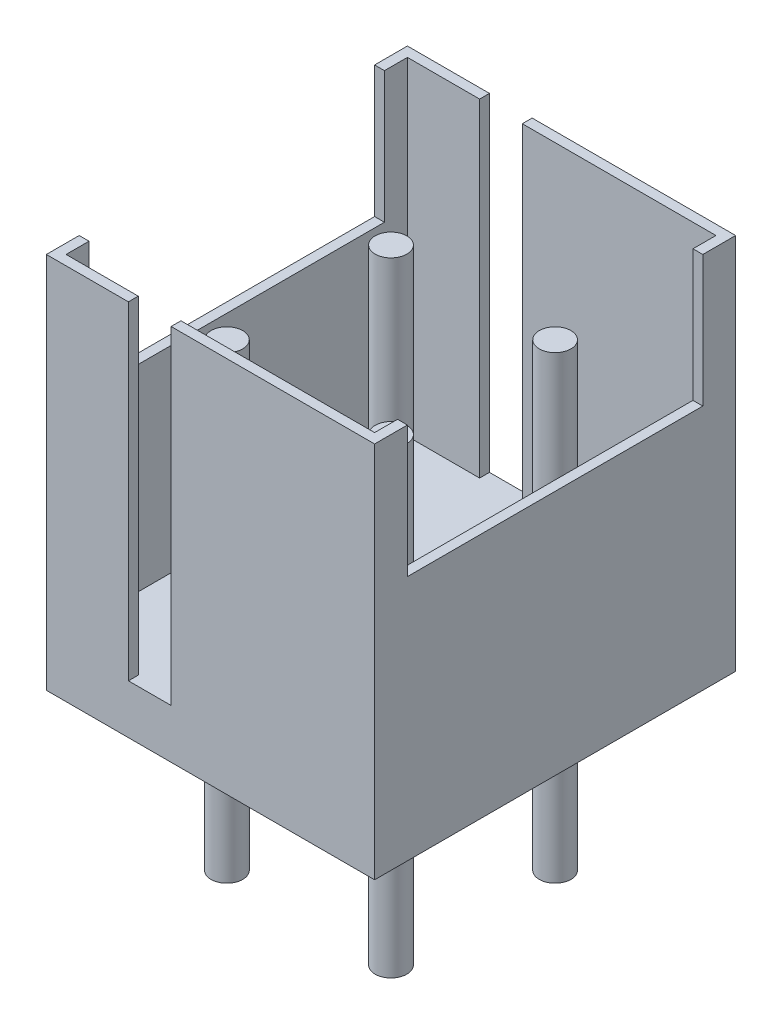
ISO-10303-21;
HEADER;
FILE_DESCRIPTION(('STEP AP214'),'2;1');
FILE_NAME('part.step','',(''),(''),'','','');
FILE_SCHEMA(('AUTOMOTIVE_DESIGN { 1 0 10303 214 1 1 1 1 }'));
ENDSEC;
DATA;
#1=APPLICATION_CONTEXT('core data for automotive mechanical design processes');
#2=APPLICATION_PROTOCOL_DEFINITION('international standard','automotive_design',2000,#1);
#3=PRODUCT_CONTEXT('',#1,'mechanical');
#4=PRODUCT('Part','Part','',(#3));
#5=PRODUCT_RELATED_PRODUCT_CATEGORY('part','',(#4));
#6=PRODUCT_DEFINITION_FORMATION('','',#4);
#7=PRODUCT_DEFINITION_CONTEXT('part definition',#1,'design');
#8=PRODUCT_DEFINITION('design','',#6,#7);
#9=PRODUCT_DEFINITION_SHAPE('','',#8);
#10=(LENGTH_UNIT() NAMED_UNIT(*) SI_UNIT(.MILLI.,.METRE.));
#11=(NAMED_UNIT(*) PLANE_ANGLE_UNIT() SI_UNIT($,.RADIAN.));
#12=(NAMED_UNIT(*) SI_UNIT($,.STERADIAN.) SOLID_ANGLE_UNIT());
#13=UNCERTAINTY_MEASURE_WITH_UNIT(LENGTH_MEASURE(1.E-05),#10,'distance_accuracy_value','');
#14=(GEOMETRIC_REPRESENTATION_CONTEXT(3) GLOBAL_UNCERTAINTY_ASSIGNED_CONTEXT((#13)) GLOBAL_UNIT_ASSIGNED_CONTEXT((#10,
#11,#12)) REPRESENTATION_CONTEXT('',''));
#15=CARTESIAN_POINT('',(0.,0.,0.));
#16=DIRECTION('',(0.,0.,1.));
#17=DIRECTION('',(1.,0.,0.));
#18=AXIS2_PLACEMENT_3D('',#15,#16,#17);
#19=CARTESIAN_POINT('',(45.518438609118,6.096,-9.09228845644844));
#20=DIRECTION('',(0.,1.,0.));
#21=DIRECTION('',(0.,0.,-1.));
#22=AXIS2_PLACEMENT_3D('',#19,#20,#21);
#23=PLANE('',#22);
#24=CARTESIAN_POINT('',(42.672,6.09599999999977,-9.398));
#25=DIRECTION('',(0.,1.,0.));
#26=DIRECTION('',(0.,0.,1.));
#27=AXIS2_PLACEMENT_3D('',#24,#25,#26);
#28=CIRCLE('',#27,0.24510725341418);
#29=CARTESIAN_POINT('',(42.672,6.09599999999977,-9.15289274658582));
#30=VERTEX_POINT('',#29);
#31=EDGE_CURVE('E20',#30,#30,#28,.T.);
#32=ORIENTED_EDGE('',*,*,#31,.T.);
#33=EDGE_LOOP('',(#32));
#34=FACE_BOUND('',#33,.T.);
#35=ADVANCED_FACE('F16',(#34),#23,.T.);
#36=CARTESIAN_POINT('',(45.518438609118,6.096,-9.09228845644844));
#37=DIRECTION('',(0.,1.,0.));
#38=DIRECTION('',(0.,0.,-1.));
#39=AXIS2_PLACEMENT_3D('',#36,#37,#38);
#40=PLANE('',#39);
#41=CARTESIAN_POINT('',(42.672,6.09599999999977,-11.938));
#42=DIRECTION('',(0.,1.,0.));
#43=DIRECTION('',(0.,0.,1.));
#44=AXIS2_PLACEMENT_3D('',#41,#42,#43);
#45=CIRCLE('',#44,0.24510725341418);
#46=CARTESIAN_POINT('',(42.672,6.09599999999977,-11.6928927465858));
#47=VERTEX_POINT('',#46);
#48=EDGE_CURVE('E248',#47,#47,#45,.T.);
#49=ORIENTED_EDGE('',*,*,#48,.T.);
#50=EDGE_LOOP('',(#49));
#51=FACE_BOUND('',#50,.T.);
#52=ADVANCED_FACE('F569',(#51),#40,.T.);
#53=CARTESIAN_POINT('',(45.518438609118,6.096,-9.09228845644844));
#54=DIRECTION('',(0.,1.,0.));
#55=DIRECTION('',(0.,0.,-1.));
#56=AXIS2_PLACEMENT_3D('',#53,#54,#55);
#57=PLANE('',#56);
#58=CARTESIAN_POINT('',(45.212,6.09599999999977,-11.938));
#59=DIRECTION('',(0.,1.,0.));
#60=DIRECTION('',(0.,0.,1.));
#61=AXIS2_PLACEMENT_3D('',#58,#59,#60);
#62=CIRCLE('',#61,0.24510725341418);
#63=CARTESIAN_POINT('',(45.212,6.09599999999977,-11.6928927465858));
#64=VERTEX_POINT('',#63);
#65=EDGE_CURVE('E246',#64,#64,#62,.T.);
#66=ORIENTED_EDGE('',*,*,#65,.T.);
#67=EDGE_LOOP('',(#66));
#68=FACE_BOUND('',#67,.T.);
#69=ADVANCED_FACE('F572',(#68),#57,.T.);
#70=CARTESIAN_POINT('',(45.518438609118,6.096,-9.09228845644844));
#71=DIRECTION('',(0.,1.,0.));
#72=DIRECTION('',(0.,0.,-1.));
#73=AXIS2_PLACEMENT_3D('',#70,#71,#72);
#74=PLANE('',#73);
#75=CARTESIAN_POINT('',(45.212,6.09599999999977,-9.398));
#76=DIRECTION('',(0.,1.,0.));
#77=DIRECTION('',(0.,0.,1.));
#78=AXIS2_PLACEMENT_3D('',#75,#76,#77);
#79=CIRCLE('',#78,0.24510725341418);
#80=CARTESIAN_POINT('',(45.212,6.09599999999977,-9.15289274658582));
#81=VERTEX_POINT('',#80);
#82=EDGE_CURVE('E185',#81,#81,#79,.T.);
#83=ORIENTED_EDGE('',*,*,#82,.T.);
#84=EDGE_LOOP('',(#83));
#85=FACE_BOUND('',#84,.T.);
#86=ADVANCED_FACE('F260',(#85),#74,.T.);
#87=CARTESIAN_POINT('',(42.672,2.2859999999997,-9.398));
#88=DIRECTION('',(0.,1.,0.));
#89=DIRECTION('',(0.,0.,1.));
#90=AXIS2_PLACEMENT_3D('',#87,#88,#89);
#91=CYLINDRICAL_SURFACE('',#90,0.24510725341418);
#92=ORIENTED_EDGE('',*,*,#31,.F.);
#93=EDGE_LOOP('',(#92));
#94=FACE_BOUND('',#93,.T.);
#95=CARTESIAN_POINT('',(42.672,2.2859999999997,-9.398));
#96=DIRECTION('',(0.,1.,0.));
#97=DIRECTION('',(0.,0.,1.));
#98=AXIS2_PLACEMENT_3D('',#95,#96,#97);
#99=CIRCLE('',#98,0.24510725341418);
#100=CARTESIAN_POINT('',(42.672,2.2859999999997,-9.15289274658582));
#101=VERTEX_POINT('',#100);
#102=EDGE_CURVE('E241',#101,#101,#99,.F.);
#103=ORIENTED_EDGE('',*,*,#102,.F.);
#104=EDGE_LOOP('',(#103));
#105=FACE_BOUND('',#104,.T.);
#106=ADVANCED_FACE('F256',(#94,#105),#91,.T.);
#107=CARTESIAN_POINT('',(42.672,2.2859999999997,-11.938));
#108=DIRECTION('',(0.,1.,0.));
#109=DIRECTION('',(0.,0.,1.));
#110=AXIS2_PLACEMENT_3D('',#107,#108,#109);
#111=CYLINDRICAL_SURFACE('',#110,0.24510725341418);
#112=ORIENTED_EDGE('',*,*,#48,.F.);
#113=EDGE_LOOP('',(#112));
#114=FACE_BOUND('',#113,.T.);
#115=CARTESIAN_POINT('',(42.672,2.2859999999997,-11.938));
#116=DIRECTION('',(0.,1.,0.));
#117=DIRECTION('',(0.,0.,1.));
#118=AXIS2_PLACEMENT_3D('',#115,#116,#117);
#119=CIRCLE('',#118,0.24510725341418);
#120=CARTESIAN_POINT('',(42.672,2.2859999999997,-11.6928927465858));
#121=VERTEX_POINT('',#120);
#122=EDGE_CURVE('E238',#121,#121,#119,.F.);
#123=ORIENTED_EDGE('',*,*,#122,.F.);
#124=EDGE_LOOP('',(#123));
#125=FACE_BOUND('',#124,.T.);
#126=ADVANCED_FACE('F259',(#114,#125),#111,.T.);
#127=CARTESIAN_POINT('',(45.212,2.2859999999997,-11.938));
#128=DIRECTION('',(0.,1.,0.));
#129=DIRECTION('',(0.,0.,1.));
#130=AXIS2_PLACEMENT_3D('',#127,#128,#129);
#131=CYLINDRICAL_SURFACE('',#130,0.24510725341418);
#132=ORIENTED_EDGE('',*,*,#65,.F.);
#133=EDGE_LOOP('',(#132));
#134=FACE_BOUND('',#133,.T.);
#135=CARTESIAN_POINT('',(45.212,2.2859999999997,-11.938));
#136=DIRECTION('',(0.,1.,0.));
#137=DIRECTION('',(0.,0.,1.));
#138=AXIS2_PLACEMENT_3D('',#135,#136,#137);
#139=CIRCLE('',#138,0.24510725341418);
#140=CARTESIAN_POINT('',(45.212,2.2859999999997,-11.6928927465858));
#141=VERTEX_POINT('',#140);
#142=EDGE_CURVE('E235',#141,#141,#139,.F.);
#143=ORIENTED_EDGE('',*,*,#142,.F.);
#144=EDGE_LOOP('',(#143));
#145=FACE_BOUND('',#144,.T.);
#146=ADVANCED_FACE('F277',(#134,#145),#131,.T.);
#147=CARTESIAN_POINT('',(45.212,2.2859999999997,-9.398));
#148=DIRECTION('',(0.,1.,0.));
#149=DIRECTION('',(0.,0.,1.));
#150=AXIS2_PLACEMENT_3D('',#147,#148,#149);
#151=CYLINDRICAL_SURFACE('',#150,0.24510725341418);
#152=ORIENTED_EDGE('',*,*,#82,.F.);
#153=EDGE_LOOP('',(#152));
#154=FACE_BOUND('',#153,.T.);
#155=CARTESIAN_POINT('',(45.212,2.2859999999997,-9.398));
#156=DIRECTION('',(0.,1.,0.));
#157=DIRECTION('',(0.,0.,1.));
#158=AXIS2_PLACEMENT_3D('',#155,#156,#157);
#159=CIRCLE('',#158,0.24510725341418);
#160=CARTESIAN_POINT('',(45.212,2.2859999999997,-9.15289274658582));
#161=VERTEX_POINT('',#160);
#162=EDGE_CURVE('E231',#161,#161,#159,.F.);
#163=ORIENTED_EDGE('',*,*,#162,.F.);
#164=EDGE_LOOP('',(#163));
#165=FACE_BOUND('',#164,.T.);
#166=ADVANCED_FACE('F266',(#154,#165),#151,.T.);
#167=CARTESIAN_POINT('',(46.425104,2.286,-7.76224));
#168=DIRECTION('',(0.,1.,0.));
#169=DIRECTION('',(0.,0.,-1.));
#170=AXIS2_PLACEMENT_3D('',#167,#168,#169);
#171=PLANE('',#170);
#172=ORIENTED_EDGE('',*,*,#162,.T.);
#173=EDGE_LOOP('',(#172));
#174=FACE_BOUND('',#173,.T.);
#175=ORIENTED_EDGE('',*,*,#142,.T.);
#176=EDGE_LOOP('',(#175));
#177=FACE_BOUND('',#176,.T.);
#178=ORIENTED_EDGE('',*,*,#122,.T.);
#179=EDGE_LOOP('',(#178));
#180=FACE_BOUND('',#179,.T.);
#181=ORIENTED_EDGE('',*,*,#102,.T.);
#182=EDGE_LOOP('',(#181));
#183=FACE_BOUND('',#182,.T.);
#184=DIRECTION('',(1.,0.,0.));
#185=VECTOR('',#184,1.);
#186=CARTESIAN_POINT('',(42.1132,2.286,-8.0264));
#187=LINE('',#186,#185);
#188=CARTESIAN_POINT('',(41.5544,2.286,-8.0264));
#189=VERTEX_POINT('',#188);
#190=CARTESIAN_POINT('',(42.672,2.286,-8.02639999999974));
#191=VERTEX_POINT('',#190);
#192=EDGE_CURVE('E460',#189,#191,#187,.T.);
#193=ORIENTED_EDGE('',*,*,#192,.T.);
#194=DIRECTION('',(0.,0.,1.));
#195=VECTOR('',#194,1.);
#196=CARTESIAN_POINT('',(42.672,2.286,-10.668));
#197=LINE('',#196,#195);
#198=CARTESIAN_POINT('',(42.672,2.286,-7.87400000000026));
#199=VERTEX_POINT('',#198);
#200=EDGE_CURVE('E175',#191,#199,#197,.T.);
#201=ORIENTED_EDGE('',*,*,#200,.T.);
#202=DIRECTION('',(1.,0.,0.));
#203=VECTOR('',#202,1.);
#204=CARTESIAN_POINT('',(43.942,2.286,-7.874));
#205=LINE('',#204,#203);
#206=CARTESIAN_POINT('',(43.3324,2.286,-7.87400000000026));
#207=VERTEX_POINT('',#206);
#208=EDGE_CURVE('E178',#199,#207,#205,.T.);
#209=ORIENTED_EDGE('',*,*,#208,.T.);
#210=DIRECTION('',(0.,0.,-1.));
#211=VECTOR('',#210,1.);
#212=CARTESIAN_POINT('',(43.3324,2.286,-10.668));
#213=LINE('',#212,#211);
#214=CARTESIAN_POINT('',(43.3324,2.286,-8.02639999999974));
#215=VERTEX_POINT('',#214);
#216=EDGE_CURVE('E182',#207,#215,#213,.T.);
#217=ORIENTED_EDGE('',*,*,#216,.T.);
#218=DIRECTION('',(1.,0.,0.));
#219=VECTOR('',#218,1.);
#220=CARTESIAN_POINT('',(44.831,2.286,-8.0264));
#221=LINE('',#220,#219);
#222=CARTESIAN_POINT('',(46.3296,2.286,-8.0264));
#223=VERTEX_POINT('',#222);
#224=EDGE_CURVE('E458',#215,#223,#221,.T.);
#225=ORIENTED_EDGE('',*,*,#224,.T.);
#226=DIRECTION('',(0.,0.,-1.));
#227=VECTOR('',#226,1.);
#228=CARTESIAN_POINT('',(46.3296,2.286,-10.668));
#229=LINE('',#228,#227);
#230=CARTESIAN_POINT('',(46.3296,2.286,-13.3096));
#231=VERTEX_POINT('',#230);
#232=EDGE_CURVE('E453',#223,#231,#229,.T.);
#233=ORIENTED_EDGE('',*,*,#232,.T.);
#234=DIRECTION('',(-1.,0.,0.));
#235=VECTOR('',#234,1.);
#236=CARTESIAN_POINT('',(44.831,2.286,-13.3096));
#237=LINE('',#236,#235);
#238=CARTESIAN_POINT('',(43.3324,2.286,-13.3096000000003));
#239=VERTEX_POINT('',#238);
#240=EDGE_CURVE('E445',#231,#239,#237,.T.);
#241=ORIENTED_EDGE('',*,*,#240,.T.);
#242=DIRECTION('',(0.,0.,-1.));
#243=VECTOR('',#242,1.);
#244=CARTESIAN_POINT('',(43.3324,2.286,-10.668));
#245=LINE('',#244,#243);
#246=CARTESIAN_POINT('',(43.3324,2.286,-13.4619999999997));
#247=VERTEX_POINT('',#246);
#248=EDGE_CURVE('E202',#239,#247,#245,.T.);
#249=ORIENTED_EDGE('',*,*,#248,.T.);
#250=DIRECTION('',(-1.,0.,0.));
#251=VECTOR('',#250,1.);
#252=CARTESIAN_POINT('',(43.942,2.286,-13.462));
#253=LINE('',#252,#251);
#254=CARTESIAN_POINT('',(42.672,2.286,-13.4619999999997));
#255=VERTEX_POINT('',#254);
#256=EDGE_CURVE('E204',#247,#255,#253,.T.);
#257=ORIENTED_EDGE('',*,*,#256,.T.);
#258=DIRECTION('',(0.,0.,1.));
#259=VECTOR('',#258,1.);
#260=CARTESIAN_POINT('',(42.672,2.286,-10.668));
#261=LINE('',#260,#259);
#262=CARTESIAN_POINT('',(42.672,2.286,-13.3096000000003));
#263=VERTEX_POINT('',#262);
#264=EDGE_CURVE('E464',#255,#263,#261,.T.);
#265=ORIENTED_EDGE('',*,*,#264,.T.);
#266=DIRECTION('',(-1.,0.,0.));
#267=VECTOR('',#266,1.);
#268=CARTESIAN_POINT('',(42.1132,2.286,-13.3096));
#269=LINE('',#268,#267);
#270=CARTESIAN_POINT('',(41.5544,2.286,-13.3096));
#271=VERTEX_POINT('',#270);
#272=EDGE_CURVE('E441',#263,#271,#269,.T.);
#273=ORIENTED_EDGE('',*,*,#272,.T.);
#274=DIRECTION('',(0.,0.,1.));
#275=VECTOR('',#274,1.);
#276=CARTESIAN_POINT('',(41.5544,2.286,-10.668));
#277=LINE('',#276,#275);
#278=EDGE_CURVE('E435',#271,#189,#277,.T.);
#279=ORIENTED_EDGE('',*,*,#278,.T.);
#280=EDGE_LOOP('',(#193,#201,#209,#217,#225,#233,#241,#249,#257,#265,#273,#279));
#281=FACE_BOUND('',#280,.T.);
#282=ADVANCED_FACE('F180',(#174,#177,#180,#183,#281),#171,.T.);
#283=CARTESIAN_POINT('',(41.532048,2.1844,-8.0264));
#284=DIRECTION('',(0.,0.,1.));
#285=DIRECTION('',(1.,0.,0.));
#286=AXIS2_PLACEMENT_3D('',#283,#284,#285);
#287=PLANE('',#286);
#288=ORIENTED_EDGE('',*,*,#192,.F.);
#289=DIRECTION('',(0.,1.,0.));
#290=VECTOR('',#289,1.);
#291=CARTESIAN_POINT('',(41.5544,4.826,-8.0264));
#292=LINE('',#291,#290);
#293=CARTESIAN_POINT('',(41.5544,7.366,-8.0264));
#294=VERTEX_POINT('',#293);
#295=EDGE_CURVE('E432',#189,#294,#292,.T.);
#296=ORIENTED_EDGE('',*,*,#295,.T.);
#297=DIRECTION('',(-1.,0.,0.));
#298=VECTOR('',#297,1.);
#299=CARTESIAN_POINT('',(42.1132,7.366,-8.0264));
#300=LINE('',#299,#298);
#301=CARTESIAN_POINT('',(42.672,7.366,-8.02639999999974));
#302=VERTEX_POINT('',#301);
#303=EDGE_CURVE('E234',#302,#294,#300,.T.);
#304=ORIENTED_EDGE('',*,*,#303,.F.);
#305=DIRECTION('',(0.,-1.,0.));
#306=VECTOR('',#305,1.);
#307=CARTESIAN_POINT('',(42.672,4.826,-8.02639999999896));
#308=LINE('',#307,#306);
#309=EDGE_CURVE('E429',#302,#191,#308,.T.);
#310=ORIENTED_EDGE('',*,*,#309,.T.);
#311=EDGE_LOOP('',(#288,#296,#304,#310));
#312=FACE_BOUND('',#311,.T.);
#313=ADVANCED_FACE('F265',(#312),#287,.F.);
#314=CARTESIAN_POINT('',(43.272456,2.1844,-8.0264));
#315=DIRECTION('',(0.,0.,1.));
#316=DIRECTION('',(1.,0.,0.));
#317=AXIS2_PLACEMENT_3D('',#314,#315,#316);
#318=PLANE('',#317);
#319=ORIENTED_EDGE('',*,*,#224,.F.);
#320=DIRECTION('',(0.,1.,0.));
#321=VECTOR('',#320,1.);
#322=CARTESIAN_POINT('',(43.3324,4.826,-8.02639999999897));
#323=LINE('',#322,#321);
#324=CARTESIAN_POINT('',(43.3324,7.366,-8.02639999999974));
#325=VERTEX_POINT('',#324);
#326=EDGE_CURVE('E201',#215,#325,#323,.T.);
#327=ORIENTED_EDGE('',*,*,#326,.T.);
#328=DIRECTION('',(-1.,0.,0.));
#329=VECTOR('',#328,1.);
#330=CARTESIAN_POINT('',(43.942,7.366,-8.0264));
#331=LINE('',#330,#329);
#332=CARTESIAN_POINT('',(46.3296,7.366,-8.0264));
#333=VERTEX_POINT('',#332);
#334=EDGE_CURVE('E424',#333,#325,#331,.T.);
#335=ORIENTED_EDGE('',*,*,#334,.F.);
#336=DIRECTION('',(0.,-1.,0.));
#337=VECTOR('',#336,1.);
#338=CARTESIAN_POINT('',(46.3296,4.826,-8.0264));
#339=LINE('',#338,#337);
#340=EDGE_CURVE('E455',#333,#223,#339,.T.);
#341=ORIENTED_EDGE('',*,*,#340,.T.);
#342=EDGE_LOOP('',(#319,#327,#335,#341));
#343=FACE_BOUND('',#342,.T.);
#344=ADVANCED_FACE('F274',(#343),#318,.F.);
#345=CARTESIAN_POINT('',(46.3296,2.1844,-7.920736));
#346=DIRECTION('',(1.,0.,0.));
#347=DIRECTION('',(0.,0.,-1.));
#348=AXIS2_PLACEMENT_3D('',#345,#346,#347);
#349=PLANE('',#348);
#350=DIRECTION('',(0.,0.,1.));
#351=VECTOR('',#350,1.);
#352=CARTESIAN_POINT('',(46.3296,7.366,-10.668));
#353=LINE('',#352,#351);
#354=CARTESIAN_POINT('',(46.3296,7.366,-13.3096));
#355=VERTEX_POINT('',#354);
#356=CARTESIAN_POINT('',(46.3295999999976,7.366,-12.954));
#357=VERTEX_POINT('',#356);
#358=EDGE_CURVE('E451',#355,#357,#353,.T.);
#359=ORIENTED_EDGE('',*,*,#358,.F.);
#360=DIRECTION('',(0.,-1.,0.));
#361=VECTOR('',#360,1.);
#362=CARTESIAN_POINT('',(46.3296,4.826,-13.3096));
#363=LINE('',#362,#361);
#364=EDGE_CURVE('E448',#355,#231,#363,.T.);
#365=ORIENTED_EDGE('',*,*,#364,.T.);
#366=ORIENTED_EDGE('',*,*,#232,.F.);
#367=ORIENTED_EDGE('',*,*,#340,.F.);
#368=DIRECTION('',(0.,0.,1.));
#369=VECTOR('',#368,1.);
#370=CARTESIAN_POINT('',(46.3296,7.366,-10.668));
#371=LINE('',#370,#369);
#372=CARTESIAN_POINT('',(46.3295999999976,7.366,-8.382));
#373=VERTEX_POINT('',#372);
#374=EDGE_CURVE('E426',#373,#333,#371,.T.);
#375=ORIENTED_EDGE('',*,*,#374,.F.);
#376=DIRECTION('',(0.,-1.,0.));
#377=VECTOR('',#376,1.);
#378=CARTESIAN_POINT('',(46.3295999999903,6.35,-8.382));
#379=LINE('',#378,#377);
#380=CARTESIAN_POINT('',(46.3295999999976,5.334,-8.382));
#381=VERTEX_POINT('',#380);
#382=EDGE_CURVE('E411',#373,#381,#379,.T.);
#383=ORIENTED_EDGE('',*,*,#382,.T.);
#384=DIRECTION('',(0.,0.,1.));
#385=VECTOR('',#384,1.);
#386=CARTESIAN_POINT('',(46.3296,5.334,-10.668));
#387=LINE('',#386,#385);
#388=CARTESIAN_POINT('',(46.3295999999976,5.334,-12.954));
#389=VERTEX_POINT('',#388);
#390=EDGE_CURVE('E417',#389,#381,#387,.T.);
#391=ORIENTED_EDGE('',*,*,#390,.F.);
#392=DIRECTION('',(0.,1.,0.));
#393=VECTOR('',#392,1.);
#394=CARTESIAN_POINT('',(46.3295999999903,6.35,-12.954));
#395=LINE('',#394,#393);
#396=EDGE_CURVE('E402',#389,#357,#395,.T.);
#397=ORIENTED_EDGE('',*,*,#396,.T.);
#398=EDGE_LOOP('',(#359,#365,#366,#367,#375,#383,#391,#397));
#399=FACE_BOUND('',#398,.T.);
#400=ADVANCED_FACE('F649',(#399),#349,.F.);
#401=CARTESIAN_POINT('',(46.389544,2.1844,-13.3096));
#402=DIRECTION('',(0.,0.,-1.));
#403=DIRECTION('',(-1.,0.,0.));
#404=AXIS2_PLACEMENT_3D('',#401,#402,#403);
#405=PLANE('',#404);
#406=ORIENTED_EDGE('',*,*,#240,.F.);
#407=ORIENTED_EDGE('',*,*,#364,.F.);
#408=DIRECTION('',(1.,0.,0.));
#409=VECTOR('',#408,1.);
#410=CARTESIAN_POINT('',(43.942,7.366,-13.3096));
#411=LINE('',#410,#409);
#412=CARTESIAN_POINT('',(43.3324,7.366,-13.3096000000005));
#413=VERTEX_POINT('',#412);
#414=EDGE_CURVE('E391',#413,#355,#411,.T.);
#415=ORIENTED_EDGE('',*,*,#414,.F.);
#416=DIRECTION('',(0.,-1.,0.));
#417=VECTOR('',#416,1.);
#418=CARTESIAN_POINT('',(43.3324,4.826,-13.309600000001));
#419=LINE('',#418,#417);
#420=EDGE_CURVE('E399',#413,#239,#419,.T.);
#421=ORIENTED_EDGE('',*,*,#420,.T.);
#422=EDGE_LOOP('',(#406,#407,#415,#421));
#423=FACE_BOUND('',#422,.T.);
#424=ADVANCED_FACE('F657',(#423),#405,.F.);
#425=CARTESIAN_POINT('',(42.694352,2.1844,-13.3096));
#426=DIRECTION('',(0.,0.,-1.));
#427=DIRECTION('',(-1.,0.,0.));
#428=AXIS2_PLACEMENT_3D('',#425,#426,#427);
#429=PLANE('',#428);
#430=ORIENTED_EDGE('',*,*,#272,.F.);
#431=DIRECTION('',(0.,1.,0.));
#432=VECTOR('',#431,1.);
#433=CARTESIAN_POINT('',(42.672,4.826,-13.309600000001));
#434=LINE('',#433,#432);
#435=CARTESIAN_POINT('',(42.672,7.366,-13.3096000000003));
#436=VERTEX_POINT('',#435);
#437=EDGE_CURVE('E388',#263,#436,#434,.T.);
#438=ORIENTED_EDGE('',*,*,#437,.T.);
#439=DIRECTION('',(1.,0.,0.));
#440=VECTOR('',#439,1.);
#441=CARTESIAN_POINT('',(42.1132,7.366,-13.3096));
#442=LINE('',#441,#440);
#443=CARTESIAN_POINT('',(41.5544,7.366,-13.3096));
#444=VERTEX_POINT('',#443);
#445=EDGE_CURVE('E443',#444,#436,#442,.T.);
#446=ORIENTED_EDGE('',*,*,#445,.F.);
#447=DIRECTION('',(0.,-1.,0.));
#448=VECTOR('',#447,1.);
#449=CARTESIAN_POINT('',(41.5544,4.826,-13.3096));
#450=LINE('',#449,#448);
#451=EDGE_CURVE('E438',#444,#271,#450,.T.);
#452=ORIENTED_EDGE('',*,*,#451,.T.);
#453=EDGE_LOOP('',(#430,#438,#446,#452));
#454=FACE_BOUND('',#453,.T.);
#455=ADVANCED_FACE('F477',(#454),#429,.F.);
#456=CARTESIAN_POINT('',(41.5544,2.1844,-13.415264));
#457=DIRECTION('',(-1.,0.,0.));
#458=DIRECTION('',(0.,0.,1.));
#459=AXIS2_PLACEMENT_3D('',#456,#457,#458);
#460=PLANE('',#459);
#461=DIRECTION('',(0.,0.,-1.));
#462=VECTOR('',#461,1.);
#463=CARTESIAN_POINT('',(41.5544,7.366,-10.668));
#464=LINE('',#463,#462);
#465=CARTESIAN_POINT('',(41.5544000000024,7.366,-8.382));
#466=VERTEX_POINT('',#465);
#467=EDGE_CURVE('E367',#294,#466,#464,.T.);
#468=ORIENTED_EDGE('',*,*,#467,.F.);
#469=ORIENTED_EDGE('',*,*,#295,.F.);
#470=ORIENTED_EDGE('',*,*,#278,.F.);
#471=ORIENTED_EDGE('',*,*,#451,.F.);
#472=DIRECTION('',(0.,0.,-1.));
#473=VECTOR('',#472,1.);
#474=CARTESIAN_POINT('',(41.5544,7.366,-10.668));
#475=LINE('',#474,#473);
#476=CARTESIAN_POINT('',(41.5544000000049,7.366,-12.954));
#477=VERTEX_POINT('',#476);
#478=EDGE_CURVE('E374',#477,#444,#475,.T.);
#479=ORIENTED_EDGE('',*,*,#478,.F.);
#480=DIRECTION('',(0.,-1.,0.));
#481=VECTOR('',#480,1.);
#482=CARTESIAN_POINT('',(41.5544000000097,6.35,-12.954));
#483=LINE('',#482,#481);
#484=CARTESIAN_POINT('',(41.5544000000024,5.334,-12.954));
#485=VERTEX_POINT('',#484);
#486=EDGE_CURVE('E383',#477,#485,#483,.T.);
#487=ORIENTED_EDGE('',*,*,#486,.T.);
#488=DIRECTION('',(0.,0.,-1.));
#489=VECTOR('',#488,1.);
#490=CARTESIAN_POINT('',(41.5544,5.334,-10.668));
#491=LINE('',#490,#489);
#492=CARTESIAN_POINT('',(41.5544000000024,5.334,-8.382));
#493=VERTEX_POINT('',#492);
#494=EDGE_CURVE('E386',#493,#485,#491,.T.);
#495=ORIENTED_EDGE('',*,*,#494,.F.);
#496=DIRECTION('',(0.,1.,0.));
#497=VECTOR('',#496,1.);
#498=CARTESIAN_POINT('',(41.5544000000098,6.35,-8.382));
#499=LINE('',#498,#497);
#500=EDGE_CURVE('E358',#493,#466,#499,.T.);
#501=ORIENTED_EDGE('',*,*,#500,.T.);
#502=EDGE_LOOP('',(#468,#469,#470,#471,#479,#487,#495,#501));
#503=FACE_BOUND('',#502,.T.);
#504=ADVANCED_FACE('F483',(#503),#460,.F.);
#505=CARTESIAN_POINT('',(42.672,2.1844,-8.0399387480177));
#506=DIRECTION('',(-1.,0.,0.));
#507=DIRECTION('',(0.,0.,1.));
#508=AXIS2_PLACEMENT_3D('',#505,#506,#507);
#509=PLANE('',#508);
#510=ORIENTED_EDGE('',*,*,#200,.F.);
#511=ORIENTED_EDGE('',*,*,#309,.F.);
#512=DIRECTION('',(0.,0.,-1.));
#513=VECTOR('',#512,1.);
#514=CARTESIAN_POINT('',(42.672,7.366,-10.668));
#515=LINE('',#514,#513);
#516=CARTESIAN_POINT('',(42.672,7.366,-7.87400000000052));
#517=VERTEX_POINT('',#516);
#518=EDGE_CURVE('E369',#517,#302,#515,.T.);
#519=ORIENTED_EDGE('',*,*,#518,.F.);
#520=DIRECTION('',(0.,1.,0.));
#521=VECTOR('',#520,1.);
#522=CARTESIAN_POINT('',(42.672,4.445,-7.874));
#523=LINE('',#522,#521);
#524=EDGE_CURVE('E356',#199,#517,#523,.T.);
#525=ORIENTED_EDGE('',*,*,#524,.F.);
#526=EDGE_LOOP('',(#510,#511,#519,#525));
#527=FACE_BOUND('',#526,.T.);
#528=ADVANCED_FACE('F488',(#527),#509,.F.);
#529=CARTESIAN_POINT('',(46.5836,7.366,-7.76224));
#530=DIRECTION('',(0.,1.,0.));
#531=DIRECTION('',(0.,0.,-1.));
#532=AXIS2_PLACEMENT_3D('',#529,#530,#531);
#533=PLANE('',#532);
#534=DIRECTION('',(-1.,0.,0.));
#535=VECTOR('',#534,1.);
#536=CARTESIAN_POINT('',(43.942,7.366,-7.874));
#537=LINE('',#536,#535);
#538=CARTESIAN_POINT('',(46.482,7.366,-7.874));
#539=VERTEX_POINT('',#538);
#540=CARTESIAN_POINT('',(43.3324,7.366,-7.87400000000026));
#541=VERTEX_POINT('',#540);
#542=EDGE_CURVE('E192',#539,#541,#537,.T.);
#543=ORIENTED_EDGE('',*,*,#542,.F.);
#544=DIRECTION('',(0.,0.,-1.));
#545=VECTOR('',#544,1.);
#546=CARTESIAN_POINT('',(46.482,7.366,-10.668));
#547=LINE('',#546,#545);
#548=CARTESIAN_POINT('',(46.4820000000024,7.366,-8.382));
#549=VERTEX_POINT('',#548);
#550=EDGE_CURVE('E422',#539,#549,#547,.T.);
#551=ORIENTED_EDGE('',*,*,#550,.T.);
#552=DIRECTION('',(-1.,0.,0.));
#553=VECTOR('',#552,1.);
#554=CARTESIAN_POINT('',(46.4058,7.366,-8.382));
#555=LINE('',#554,#553);
#556=EDGE_CURVE('E414',#549,#373,#555,.T.);
#557=ORIENTED_EDGE('',*,*,#556,.T.);
#558=ORIENTED_EDGE('',*,*,#374,.T.);
#559=ORIENTED_EDGE('',*,*,#334,.T.);
#560=DIRECTION('',(0.,0.,1.));
#561=VECTOR('',#560,1.);
#562=CARTESIAN_POINT('',(43.3324,7.366,-7.9502));
#563=LINE('',#562,#561);
#564=EDGE_CURVE('E420',#325,#541,#563,.T.);
#565=ORIENTED_EDGE('',*,*,#564,.T.);
#566=EDGE_LOOP('',(#543,#551,#557,#558,#559,#565));
#567=FACE_BOUND('',#566,.T.);
#568=ADVANCED_FACE('F681',(#567),#533,.T.);
#569=CARTESIAN_POINT('',(43.3324,2.1844,-7.8604612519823));
#570=DIRECTION('',(1.,0.,0.));
#571=DIRECTION('',(0.,0.,-1.));
#572=AXIS2_PLACEMENT_3D('',#569,#570,#571);
#573=PLANE('',#572);
#574=ORIENTED_EDGE('',*,*,#216,.F.);
#575=DIRECTION('',(0.,-1.,0.));
#576=VECTOR('',#575,1.);
#577=CARTESIAN_POINT('',(43.3324,4.445,-7.874));
#578=LINE('',#577,#576);
#579=EDGE_CURVE('E188',#541,#207,#578,.T.);
#580=ORIENTED_EDGE('',*,*,#579,.F.);
#581=ORIENTED_EDGE('',*,*,#564,.F.);
#582=ORIENTED_EDGE('',*,*,#326,.F.);
#583=EDGE_LOOP('',(#574,#580,#581,#582));
#584=FACE_BOUND('',#583,.T.);
#585=ADVANCED_FACE('F199',(#584),#573,.F.);
#586=CARTESIAN_POINT('',(46.5836,5.334,-8.29056));
#587=DIRECTION('',(0.,1.,0.));
#588=DIRECTION('',(0.,0.,-1.));
#589=AXIS2_PLACEMENT_3D('',#586,#587,#588);
#590=PLANE('',#589);
#591=ORIENTED_EDGE('',*,*,#390,.T.);
#592=DIRECTION('',(1.,0.,0.));
#593=VECTOR('',#592,1.);
#594=CARTESIAN_POINT('',(46.4058,5.334,-8.382));
#595=LINE('',#594,#593);
#596=CARTESIAN_POINT('',(46.4820000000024,5.334,-8.382));
#597=VERTEX_POINT('',#596);
#598=EDGE_CURVE('E408',#381,#597,#595,.T.);
#599=ORIENTED_EDGE('',*,*,#598,.T.);
#600=DIRECTION('',(0.,0.,1.));
#601=VECTOR('',#600,1.);
#602=CARTESIAN_POINT('',(46.482,5.334,-10.668));
#603=LINE('',#602,#601);
#604=CARTESIAN_POINT('',(46.4820000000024,5.334,-12.954));
#605=VERTEX_POINT('',#604);
#606=EDGE_CURVE('E196',#605,#597,#603,.T.);
#607=ORIENTED_EDGE('',*,*,#606,.F.);
#608=DIRECTION('',(-1.,0.,0.));
#609=VECTOR('',#608,1.);
#610=CARTESIAN_POINT('',(46.4058,5.334,-12.954));
#611=LINE('',#610,#609);
#612=EDGE_CURVE('E405',#605,#389,#611,.T.);
#613=ORIENTED_EDGE('',*,*,#612,.T.);
#614=EDGE_LOOP('',(#591,#599,#607,#613));
#615=FACE_BOUND('',#614,.T.);
#616=ADVANCED_FACE('F692',(#615),#590,.T.);
#617=CARTESIAN_POINT('',(46.3160612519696,5.29336,-8.382));
#618=DIRECTION('',(0.,0.,1.));
#619=DIRECTION('',(1.,0.,0.));
#620=AXIS2_PLACEMENT_3D('',#617,#618,#619);
#621=PLANE('',#620);
#622=ORIENTED_EDGE('',*,*,#598,.F.);
#623=ORIENTED_EDGE('',*,*,#382,.F.);
#624=ORIENTED_EDGE('',*,*,#556,.F.);
#625=DIRECTION('',(0.,1.,0.));
#626=VECTOR('',#625,1.);
#627=CARTESIAN_POINT('',(46.482,4.445,-8.382));
#628=LINE('',#627,#626);
#629=EDGE_CURVE('E349',#597,#549,#628,.T.);
#630=ORIENTED_EDGE('',*,*,#629,.F.);
#631=EDGE_LOOP('',(#622,#623,#624,#630));
#632=FACE_BOUND('',#631,.T.);
#633=ADVANCED_FACE('F701',(#632),#621,.F.);
#634=CARTESIAN_POINT('',(46.4955387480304,5.29336,-12.954));
#635=DIRECTION('',(0.,0.,-1.));
#636=DIRECTION('',(-1.,0.,0.));
#637=AXIS2_PLACEMENT_3D('',#634,#635,#636);
#638=PLANE('',#637);
#639=ORIENTED_EDGE('',*,*,#612,.F.);
#640=DIRECTION('',(0.,-1.,0.));
#641=VECTOR('',#640,1.);
#642=CARTESIAN_POINT('',(46.482,4.445,-12.954));
#643=LINE('',#642,#641);
#644=CARTESIAN_POINT('',(46.4820000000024,7.366,-12.954));
#645=VERTEX_POINT('',#644);
#646=EDGE_CURVE('E343',#645,#605,#643,.T.);
#647=ORIENTED_EDGE('',*,*,#646,.F.);
#648=DIRECTION('',(1.,0.,0.));
#649=VECTOR('',#648,1.);
#650=CARTESIAN_POINT('',(43.942,7.366,-12.954));
#651=LINE('',#650,#649);
#652=EDGE_CURVE('E397',#357,#645,#651,.T.);
#653=ORIENTED_EDGE('',*,*,#652,.F.);
#654=ORIENTED_EDGE('',*,*,#396,.F.);
#655=EDGE_LOOP('',(#639,#647,#653,#654));
#656=FACE_BOUND('',#655,.T.);
#657=ADVANCED_FACE('F711',(#656),#638,.F.);
#658=CARTESIAN_POINT('',(43.3324,2.1844,-13.2960612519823));
#659=DIRECTION('',(1.,0.,0.));
#660=DIRECTION('',(0.,0.,-1.));
#661=AXIS2_PLACEMENT_3D('',#658,#659,#660);
#662=PLANE('',#661);
#663=ORIENTED_EDGE('',*,*,#248,.F.);
#664=ORIENTED_EDGE('',*,*,#420,.F.);
#665=DIRECTION('',(0.,0.,1.));
#666=VECTOR('',#665,1.);
#667=CARTESIAN_POINT('',(43.3324,7.366,-10.668));
#668=LINE('',#667,#666);
#669=CARTESIAN_POINT('',(43.3324,7.366,-13.4619999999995));
#670=VERTEX_POINT('',#669);
#671=EDGE_CURVE('E394',#670,#413,#668,.T.);
#672=ORIENTED_EDGE('',*,*,#671,.F.);
#673=DIRECTION('',(0.,1.,0.));
#674=VECTOR('',#673,1.);
#675=CARTESIAN_POINT('',(43.3324,4.445,-13.462));
#676=LINE('',#675,#674);
#677=EDGE_CURVE('E341',#247,#670,#676,.T.);
#678=ORIENTED_EDGE('',*,*,#677,.F.);
#679=EDGE_LOOP('',(#663,#664,#672,#678));
#680=FACE_BOUND('',#679,.T.);
#681=ADVANCED_FACE('F721',(#680),#662,.F.);
#682=CARTESIAN_POINT('',(46.5836,7.366,-7.76224));
#683=DIRECTION('',(0.,1.,0.));
#684=DIRECTION('',(0.,0.,-1.));
#685=AXIS2_PLACEMENT_3D('',#682,#683,#684);
#686=PLANE('',#685);
#687=ORIENTED_EDGE('',*,*,#414,.T.);
#688=ORIENTED_EDGE('',*,*,#358,.T.);
#689=ORIENTED_EDGE('',*,*,#652,.T.);
#690=DIRECTION('',(0.,0.,1.));
#691=VECTOR('',#690,1.);
#692=CARTESIAN_POINT('',(46.482,7.366,-10.668));
#693=LINE('',#692,#691);
#694=CARTESIAN_POINT('',(46.482,7.366,-13.462));
#695=VERTEX_POINT('',#694);
#696=EDGE_CURVE('E346',#695,#645,#693,.T.);
#697=ORIENTED_EDGE('',*,*,#696,.F.);
#698=DIRECTION('',(1.,0.,0.));
#699=VECTOR('',#698,1.);
#700=CARTESIAN_POINT('',(43.942,7.366,-13.462));
#701=LINE('',#700,#699);
#702=EDGE_CURVE('E339',#670,#695,#701,.T.);
#703=ORIENTED_EDGE('',*,*,#702,.F.);
#704=ORIENTED_EDGE('',*,*,#671,.T.);
#705=EDGE_LOOP('',(#687,#688,#689,#697,#703,#704));
#706=FACE_BOUND('',#705,.T.);
#707=ADVANCED_FACE('F731',(#706),#686,.T.);
#708=CARTESIAN_POINT('',(42.672,2.1844,-13.4755387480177));
#709=DIRECTION('',(-1.,0.,0.));
#710=DIRECTION('',(0.,0.,1.));
#711=AXIS2_PLACEMENT_3D('',#708,#709,#710);
#712=PLANE('',#711);
#713=ORIENTED_EDGE('',*,*,#264,.F.);
#714=DIRECTION('',(0.,-1.,0.));
#715=VECTOR('',#714,1.);
#716=CARTESIAN_POINT('',(42.672,4.445,-13.462));
#717=LINE('',#716,#715);
#718=CARTESIAN_POINT('',(42.672,7.366,-13.4619999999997));
#719=VERTEX_POINT('',#718);
#720=EDGE_CURVE('E332',#719,#255,#717,.T.);
#721=ORIENTED_EDGE('',*,*,#720,.F.);
#722=DIRECTION('',(0.,0.,-1.));
#723=VECTOR('',#722,1.);
#724=CARTESIAN_POINT('',(42.672,7.366,-10.668));
#725=LINE('',#724,#723);
#726=EDGE_CURVE('E372',#436,#719,#725,.T.);
#727=ORIENTED_EDGE('',*,*,#726,.F.);
#728=ORIENTED_EDGE('',*,*,#437,.F.);
#729=EDGE_LOOP('',(#713,#721,#727,#728));
#730=FACE_BOUND('',#729,.T.);
#731=ADVANCED_FACE('F475',(#730),#712,.F.);
#732=CARTESIAN_POINT('',(46.5836,5.334,-8.29056));
#733=DIRECTION('',(0.,1.,0.));
#734=DIRECTION('',(0.,0.,-1.));
#735=AXIS2_PLACEMENT_3D('',#732,#733,#734);
#736=PLANE('',#735);
#737=ORIENTED_EDGE('',*,*,#494,.T.);
#738=DIRECTION('',(-1.,0.,0.));
#739=VECTOR('',#738,1.);
#740=CARTESIAN_POINT('',(41.4782,5.334,-12.954));
#741=LINE('',#740,#739);
#742=CARTESIAN_POINT('',(41.4019999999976,5.334,-12.954));
#743=VERTEX_POINT('',#742);
#744=EDGE_CURVE('E380',#485,#743,#741,.T.);
#745=ORIENTED_EDGE('',*,*,#744,.T.);
#746=DIRECTION('',(0.,0.,-1.));
#747=VECTOR('',#746,1.);
#748=CARTESIAN_POINT('',(41.402,5.334,-10.668));
#749=LINE('',#748,#747);
#750=CARTESIAN_POINT('',(41.4019999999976,5.334,-8.382));
#751=VERTEX_POINT('',#750);
#752=EDGE_CURVE('E330',#751,#743,#749,.T.);
#753=ORIENTED_EDGE('',*,*,#752,.F.);
#754=DIRECTION('',(1.,0.,0.));
#755=VECTOR('',#754,1.);
#756=CARTESIAN_POINT('',(41.4782,5.334,-8.382));
#757=LINE('',#756,#755);
#758=EDGE_CURVE('E361',#751,#493,#757,.T.);
#759=ORIENTED_EDGE('',*,*,#758,.T.);
#760=EDGE_LOOP('',(#737,#745,#753,#759));
#761=FACE_BOUND('',#760,.T.);
#762=ADVANCED_FACE('F502',(#761),#736,.T.);
#763=CARTESIAN_POINT('',(41.5679387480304,5.29336,-12.954));
#764=DIRECTION('',(0.,0.,-1.));
#765=DIRECTION('',(-1.,0.,0.));
#766=AXIS2_PLACEMENT_3D('',#763,#764,#765);
#767=PLANE('',#766);
#768=ORIENTED_EDGE('',*,*,#744,.F.);
#769=ORIENTED_EDGE('',*,*,#486,.F.);
#770=DIRECTION('',(1.,0.,0.));
#771=VECTOR('',#770,1.);
#772=CARTESIAN_POINT('',(43.942,7.366,-12.954));
#773=LINE('',#772,#771);
#774=CARTESIAN_POINT('',(41.4019999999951,7.366,-12.954));
#775=VERTEX_POINT('',#774);
#776=EDGE_CURVE('E377',#775,#477,#773,.T.);
#777=ORIENTED_EDGE('',*,*,#776,.F.);
#778=DIRECTION('',(0.,1.,0.));
#779=VECTOR('',#778,1.);
#780=CARTESIAN_POINT('',(41.402,4.445,-12.954));
#781=LINE('',#780,#779);
#782=EDGE_CURVE('E328',#743,#775,#781,.T.);
#783=ORIENTED_EDGE('',*,*,#782,.F.);
#784=EDGE_LOOP('',(#768,#769,#777,#783));
#785=FACE_BOUND('',#784,.T.);
#786=ADVANCED_FACE('F508',(#785),#767,.F.);
#787=CARTESIAN_POINT('',(46.5836,7.366,-7.76224));
#788=DIRECTION('',(0.,1.,0.));
#789=DIRECTION('',(0.,0.,-1.));
#790=AXIS2_PLACEMENT_3D('',#787,#788,#789);
#791=PLANE('',#790);
#792=DIRECTION('',(1.,0.,0.));
#793=VECTOR('',#792,1.);
#794=CARTESIAN_POINT('',(43.942,7.366,-13.462));
#795=LINE('',#794,#793);
#796=CARTESIAN_POINT('',(41.402,7.366,-13.462));
#797=VERTEX_POINT('',#796);
#798=EDGE_CURVE('E335',#797,#719,#795,.T.);
#799=ORIENTED_EDGE('',*,*,#798,.F.);
#800=DIRECTION('',(0.,0.,-1.));
#801=VECTOR('',#800,1.);
#802=CARTESIAN_POINT('',(41.402,7.366,-10.668));
#803=LINE('',#802,#801);
#804=EDGE_CURVE('E326',#775,#797,#803,.T.);
#805=ORIENTED_EDGE('',*,*,#804,.F.);
#806=ORIENTED_EDGE('',*,*,#776,.T.);
#807=ORIENTED_EDGE('',*,*,#478,.T.);
#808=ORIENTED_EDGE('',*,*,#445,.T.);
#809=ORIENTED_EDGE('',*,*,#726,.T.);
#810=EDGE_LOOP('',(#799,#805,#806,#807,#808,#809));
#811=FACE_BOUND('',#810,.T.);
#812=ADVANCED_FACE('F510',(#811),#791,.T.);
#813=CARTESIAN_POINT('',(46.5836,7.366,-7.76224));
#814=DIRECTION('',(0.,1.,0.));
#815=DIRECTION('',(0.,0.,-1.));
#816=AXIS2_PLACEMENT_3D('',#813,#814,#815);
#817=PLANE('',#816);
#818=ORIENTED_EDGE('',*,*,#303,.T.);
#819=ORIENTED_EDGE('',*,*,#467,.T.);
#820=DIRECTION('',(-1.,0.,0.));
#821=VECTOR('',#820,1.);
#822=CARTESIAN_POINT('',(41.4782,7.366,-8.382));
#823=LINE('',#822,#821);
#824=CARTESIAN_POINT('',(41.4019999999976,7.366,-8.382));
#825=VERTEX_POINT('',#824);
#826=EDGE_CURVE('E364',#466,#825,#823,.T.);
#827=ORIENTED_EDGE('',*,*,#826,.T.);
#828=DIRECTION('',(0.,0.,-1.));
#829=VECTOR('',#828,1.);
#830=CARTESIAN_POINT('',(41.402,7.366,-10.668));
#831=LINE('',#830,#829);
#832=CARTESIAN_POINT('',(41.402,7.366,-7.874));
#833=VERTEX_POINT('',#832);
#834=EDGE_CURVE('E320',#833,#825,#831,.T.);
#835=ORIENTED_EDGE('',*,*,#834,.F.);
#836=DIRECTION('',(-1.,0.,0.));
#837=VECTOR('',#836,1.);
#838=CARTESIAN_POINT('',(43.942,7.366,-7.874));
#839=LINE('',#838,#837);
#840=EDGE_CURVE('E354',#517,#833,#839,.T.);
#841=ORIENTED_EDGE('',*,*,#840,.F.);
#842=ORIENTED_EDGE('',*,*,#518,.T.);
#843=EDGE_LOOP('',(#818,#819,#827,#835,#841,#842));
#844=FACE_BOUND('',#843,.T.);
#845=ADVANCED_FACE('F491',(#844),#817,.T.);
#846=CARTESIAN_POINT('',(41.3884612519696,5.29336,-8.382));
#847=DIRECTION('',(0.,0.,1.));
#848=DIRECTION('',(1.,0.,0.));
#849=AXIS2_PLACEMENT_3D('',#846,#847,#848);
#850=PLANE('',#849);
#851=ORIENTED_EDGE('',*,*,#758,.F.);
#852=DIRECTION('',(0.,-1.,0.));
#853=VECTOR('',#852,1.);
#854=CARTESIAN_POINT('',(41.402,4.445,-8.382));
#855=LINE('',#854,#853);
#856=EDGE_CURVE('E230',#825,#751,#855,.T.);
#857=ORIENTED_EDGE('',*,*,#856,.F.);
#858=ORIENTED_EDGE('',*,*,#826,.F.);
#859=ORIENTED_EDGE('',*,*,#500,.F.);
#860=EDGE_LOOP('',(#851,#857,#858,#859));
#861=FACE_BOUND('',#860,.T.);
#862=ADVANCED_FACE('F500',(#861),#850,.F.);
#863=CARTESIAN_POINT('',(45.518438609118,-1.016,-9.09228845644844));
#864=DIRECTION('',(0.,1.,0.));
#865=DIRECTION('',(0.,0.,-1.));
#866=AXIS2_PLACEMENT_3D('',#863,#864,#865);
#867=PLANE('',#866);
#868=CARTESIAN_POINT('',(42.672,-1.01599999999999,-9.398));
#869=DIRECTION('',(0.,1.,0.));
#870=DIRECTION('',(0.,0.,1.));
#871=AXIS2_PLACEMENT_3D('',#868,#869,#870);
#872=CIRCLE('',#871,0.245107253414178);
#873=CARTESIAN_POINT('',(42.672,-1.01599999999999,-9.15289274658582));
#874=VERTEX_POINT('',#873);
#875=EDGE_CURVE('E227',#874,#874,#872,.F.);
#876=ORIENTED_EDGE('',*,*,#875,.T.);
#877=EDGE_LOOP('',(#876));
#878=FACE_BOUND('',#877,.T.);
#879=ADVANCED_FACE('F523',(#878),#867,.F.);
#880=CARTESIAN_POINT('',(45.518438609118,-1.016,-9.09228845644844));
#881=DIRECTION('',(0.,1.,0.));
#882=DIRECTION('',(0.,0.,-1.));
#883=AXIS2_PLACEMENT_3D('',#880,#881,#882);
#884=PLANE('',#883);
#885=CARTESIAN_POINT('',(42.672,-1.01599999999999,-11.938));
#886=DIRECTION('',(0.,1.,0.));
#887=DIRECTION('',(0.,0.,1.));
#888=AXIS2_PLACEMENT_3D('',#885,#886,#887);
#889=CIRCLE('',#888,0.245107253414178);
#890=CARTESIAN_POINT('',(42.672,-1.01599999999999,-11.6928927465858));
#891=VERTEX_POINT('',#890);
#892=EDGE_CURVE('E224',#891,#891,#889,.F.);
#893=ORIENTED_EDGE('',*,*,#892,.T.);
#894=EDGE_LOOP('',(#893));
#895=FACE_BOUND('',#894,.T.);
#896=ADVANCED_FACE('F526',(#895),#884,.F.);
#897=CARTESIAN_POINT('',(45.518438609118,-1.016,-9.09228845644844));
#898=DIRECTION('',(0.,1.,0.));
#899=DIRECTION('',(0.,0.,-1.));
#900=AXIS2_PLACEMENT_3D('',#897,#898,#899);
#901=PLANE('',#900);
#902=CARTESIAN_POINT('',(45.212,-1.01599999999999,-11.938));
#903=DIRECTION('',(0.,1.,0.));
#904=DIRECTION('',(0.,0.,1.));
#905=AXIS2_PLACEMENT_3D('',#902,#903,#904);
#906=CIRCLE('',#905,0.245107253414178);
#907=CARTESIAN_POINT('',(45.212,-1.01599999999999,-11.6928927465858));
#908=VERTEX_POINT('',#907);
#909=EDGE_CURVE('E221',#908,#908,#906,.F.);
#910=ORIENTED_EDGE('',*,*,#909,.T.);
#911=EDGE_LOOP('',(#910));
#912=FACE_BOUND('',#911,.T.);
#913=ADVANCED_FACE('F530',(#912),#901,.F.);
#914=CARTESIAN_POINT('',(45.518438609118,-1.016,-9.09228845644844));
#915=DIRECTION('',(0.,1.,0.));
#916=DIRECTION('',(0.,0.,-1.));
#917=AXIS2_PLACEMENT_3D('',#914,#915,#916);
#918=PLANE('',#917);
#919=CARTESIAN_POINT('',(45.212,-1.01599999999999,-9.398));
#920=DIRECTION('',(0.,1.,0.));
#921=DIRECTION('',(0.,0.,1.));
#922=AXIS2_PLACEMENT_3D('',#919,#920,#921);
#923=CIRCLE('',#922,0.245107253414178);
#924=CARTESIAN_POINT('',(45.212,-1.01599999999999,-9.15289274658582));
#925=VERTEX_POINT('',#924);
#926=EDGE_CURVE('E217',#925,#925,#923,.F.);
#927=ORIENTED_EDGE('',*,*,#926,.T.);
#928=EDGE_LOOP('',(#927));
#929=FACE_BOUND('',#928,.T.);
#930=ADVANCED_FACE('F534',(#929),#918,.F.);
#931=CARTESIAN_POINT('',(41.3004,1.40716,-7.874));
#932=DIRECTION('',(0.,0.,1.));
#933=DIRECTION('',(1.,0.,0.));
#934=AXIS2_PLACEMENT_3D('',#931,#932,#933);
#935=PLANE('',#934);
#936=ORIENTED_EDGE('',*,*,#542,.T.);
#937=ORIENTED_EDGE('',*,*,#579,.T.);
#938=ORIENTED_EDGE('',*,*,#208,.F.);
#939=ORIENTED_EDGE('',*,*,#524,.T.);
#940=ORIENTED_EDGE('',*,*,#840,.T.);
#941=DIRECTION('',(0.,1.,0.));
#942=VECTOR('',#941,1.);
#943=CARTESIAN_POINT('',(41.402,4.445,-7.874));
#944=LINE('',#943,#942);
#945=CARTESIAN_POINT('',(41.402,1.524,-7.874));
#946=VERTEX_POINT('',#945);
#947=EDGE_CURVE('E322',#946,#833,#944,.T.);
#948=ORIENTED_EDGE('',*,*,#947,.F.);
#949=DIRECTION('',(1.,0.,0.));
#950=VECTOR('',#949,1.);
#951=CARTESIAN_POINT('',(43.942,1.524,-7.874));
#952=LINE('',#951,#950);
#953=CARTESIAN_POINT('',(46.482,1.524,-7.874));
#954=VERTEX_POINT('',#953);
#955=EDGE_CURVE('E220',#946,#954,#952,.T.);
#956=ORIENTED_EDGE('',*,*,#955,.T.);
#957=DIRECTION('',(0.,-1.,0.));
#958=VECTOR('',#957,1.);
#959=CARTESIAN_POINT('',(46.482,4.445,-7.874));
#960=LINE('',#959,#958);
#961=EDGE_CURVE('E313',#539,#954,#960,.T.);
#962=ORIENTED_EDGE('',*,*,#961,.F.);
#963=EDGE_LOOP('',(#936,#937,#938,#939,#940,#948,#956,#962));
#964=FACE_BOUND('',#963,.T.);
#965=ADVANCED_FACE('F189',(#964),#935,.T.);
#966=CARTESIAN_POINT('',(46.482,1.40716,-7.76224));
#967=DIRECTION('',(1.,0.,0.));
#968=DIRECTION('',(0.,0.,-1.));
#969=AXIS2_PLACEMENT_3D('',#966,#967,#968);
#970=PLANE('',#969);
#971=ORIENTED_EDGE('',*,*,#696,.T.);
#972=ORIENTED_EDGE('',*,*,#646,.T.);
#973=ORIENTED_EDGE('',*,*,#606,.T.);
#974=ORIENTED_EDGE('',*,*,#629,.T.);
#975=ORIENTED_EDGE('',*,*,#550,.F.);
#976=ORIENTED_EDGE('',*,*,#961,.T.);
#977=DIRECTION('',(0.,0.,-1.));
#978=VECTOR('',#977,1.);
#979=CARTESIAN_POINT('',(46.482,1.524,-10.668));
#980=LINE('',#979,#978);
#981=CARTESIAN_POINT('',(46.482,1.524,-13.462));
#982=VERTEX_POINT('',#981);
#983=EDGE_CURVE('E304',#954,#982,#980,.T.);
#984=ORIENTED_EDGE('',*,*,#983,.T.);
#985=DIRECTION('',(0.,-1.,0.));
#986=VECTOR('',#985,1.);
#987=CARTESIAN_POINT('',(46.482,4.445,-13.462));
#988=LINE('',#987,#986);
#989=EDGE_CURVE('E312',#695,#982,#988,.T.);
#990=ORIENTED_EDGE('',*,*,#989,.F.);
#991=EDGE_LOOP('',(#971,#972,#973,#974,#975,#976,#984,#990));
#992=FACE_BOUND('',#991,.T.);
#993=ADVANCED_FACE('F311',(#992),#970,.T.);
#994=CARTESIAN_POINT('',(46.5836,1.40716,-13.462));
#995=DIRECTION('',(0.,0.,-1.));
#996=DIRECTION('',(-1.,0.,0.));
#997=AXIS2_PLACEMENT_3D('',#994,#995,#996);
#998=PLANE('',#997);
#999=ORIENTED_EDGE('',*,*,#798,.T.);
#1000=ORIENTED_EDGE('',*,*,#720,.T.);
#1001=ORIENTED_EDGE('',*,*,#256,.F.);
#1002=ORIENTED_EDGE('',*,*,#677,.T.);
#1003=ORIENTED_EDGE('',*,*,#702,.T.);
#1004=ORIENTED_EDGE('',*,*,#989,.T.);
#1005=DIRECTION('',(-1.,0.,0.));
#1006=VECTOR('',#1005,1.);
#1007=CARTESIAN_POINT('',(43.942,1.524,-13.462));
#1008=LINE('',#1007,#1006);
#1009=CARTESIAN_POINT('',(41.402,1.524,-13.462));
#1010=VERTEX_POINT('',#1009);
#1011=EDGE_CURVE('E302',#982,#1010,#1008,.T.);
#1012=ORIENTED_EDGE('',*,*,#1011,.T.);
#1013=DIRECTION('',(0.,-1.,0.));
#1014=VECTOR('',#1013,1.);
#1015=CARTESIAN_POINT('',(41.402,4.445,-13.462));
#1016=LINE('',#1015,#1014);
#1017=EDGE_CURVE('E35',#797,#1010,#1016,.T.);
#1018=ORIENTED_EDGE('',*,*,#1017,.F.);
#1019=EDGE_LOOP('',(#999,#1000,#1001,#1002,#1003,#1004,#1012,#1018));
#1020=FACE_BOUND('',#1019,.T.);
#1021=ADVANCED_FACE('F470',(#1020),#998,.T.);
#1022=CARTESIAN_POINT('',(41.402,1.40716,-13.57376));
#1023=DIRECTION('',(-1.,0.,0.));
#1024=DIRECTION('',(0.,0.,1.));
#1025=AXIS2_PLACEMENT_3D('',#1022,#1023,#1024);
#1026=PLANE('',#1025);
#1027=ORIENTED_EDGE('',*,*,#834,.T.);
#1028=ORIENTED_EDGE('',*,*,#856,.T.);
#1029=ORIENTED_EDGE('',*,*,#752,.T.);
#1030=ORIENTED_EDGE('',*,*,#782,.T.);
#1031=ORIENTED_EDGE('',*,*,#804,.T.);
#1032=ORIENTED_EDGE('',*,*,#1017,.T.);
#1033=DIRECTION('',(0.,0.,1.));
#1034=VECTOR('',#1033,1.);
#1035=CARTESIAN_POINT('',(41.402,1.524,-10.668));
#1036=LINE('',#1035,#1034);
#1037=EDGE_CURVE('E216',#1010,#946,#1036,.T.);
#1038=ORIENTED_EDGE('',*,*,#1037,.T.);
#1039=ORIENTED_EDGE('',*,*,#947,.T.);
#1040=EDGE_LOOP('',(#1027,#1028,#1029,#1030,#1031,#1032,#1038,#1039));
#1041=FACE_BOUND('',#1040,.T.);
#1042=ADVANCED_FACE('F494',(#1041),#1026,.T.);
#1043=CARTESIAN_POINT('',(42.672,-1.01599999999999,-9.398));
#1044=DIRECTION('',(0.,1.,0.));
#1045=DIRECTION('',(0.,0.,1.));
#1046=AXIS2_PLACEMENT_3D('',#1043,#1044,#1045);
#1047=CYLINDRICAL_SURFACE('',#1046,0.245107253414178);
#1048=ORIENTED_EDGE('',*,*,#875,.F.);
#1049=EDGE_LOOP('',(#1048));
#1050=FACE_BOUND('',#1049,.T.);
#1051=CARTESIAN_POINT('',(42.672,1.52400000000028,-9.398));
#1052=DIRECTION('',(0.,1.,0.));
#1053=DIRECTION('',(0.,0.,1.));
#1054=AXIS2_PLACEMENT_3D('',#1051,#1052,#1053);
#1055=CIRCLE('',#1054,0.245107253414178);
#1056=CARTESIAN_POINT('',(42.672,1.52400000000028,-9.15289274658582));
#1057=VERTEX_POINT('',#1056);
#1058=EDGE_CURVE('E213',#1057,#1057,#1055,.F.);
#1059=ORIENTED_EDGE('',*,*,#1058,.T.);
#1060=EDGE_LOOP('',(#1059));
#1061=FACE_BOUND('',#1060,.T.);
#1062=ADVANCED_FACE('F545',(#1050,#1061),#1047,.T.);
#1063=CARTESIAN_POINT('',(42.672,-1.01599999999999,-11.938));
#1064=DIRECTION('',(0.,1.,0.));
#1065=DIRECTION('',(0.,0.,1.));
#1066=AXIS2_PLACEMENT_3D('',#1063,#1064,#1065);
#1067=CYLINDRICAL_SURFACE('',#1066,0.245107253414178);
#1068=ORIENTED_EDGE('',*,*,#892,.F.);
#1069=EDGE_LOOP('',(#1068));
#1070=FACE_BOUND('',#1069,.T.);
#1071=CARTESIAN_POINT('',(42.672,1.52400000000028,-11.938));
#1072=DIRECTION('',(0.,1.,0.));
#1073=DIRECTION('',(0.,0.,1.));
#1074=AXIS2_PLACEMENT_3D('',#1071,#1072,#1073);
#1075=CIRCLE('',#1074,0.245107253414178);
#1076=CARTESIAN_POINT('',(42.672,1.52400000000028,-11.6928927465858));
#1077=VERTEX_POINT('',#1076);
#1078=EDGE_CURVE('E210',#1077,#1077,#1075,.F.);
#1079=ORIENTED_EDGE('',*,*,#1078,.T.);
#1080=EDGE_LOOP('',(#1079));
#1081=FACE_BOUND('',#1080,.T.);
#1082=ADVANCED_FACE('F549',(#1070,#1081),#1067,.T.);
#1083=CARTESIAN_POINT('',(45.212,-1.01599999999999,-11.938));
#1084=DIRECTION('',(0.,1.,0.));
#1085=DIRECTION('',(0.,0.,1.));
#1086=AXIS2_PLACEMENT_3D('',#1083,#1084,#1085);
#1087=CYLINDRICAL_SURFACE('',#1086,0.245107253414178);
#1088=ORIENTED_EDGE('',*,*,#909,.F.);
#1089=EDGE_LOOP('',(#1088));
#1090=FACE_BOUND('',#1089,.T.);
#1091=CARTESIAN_POINT('',(45.212,1.52400000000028,-11.938));
#1092=DIRECTION('',(0.,1.,0.));
#1093=DIRECTION('',(0.,0.,1.));
#1094=AXIS2_PLACEMENT_3D('',#1091,#1092,#1093);
#1095=CIRCLE('',#1094,0.245107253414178);
#1096=CARTESIAN_POINT('',(45.212,1.52400000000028,-11.6928927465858));
#1097=VERTEX_POINT('',#1096);
#1098=EDGE_CURVE('E26',#1097,#1097,#1095,.F.);
#1099=ORIENTED_EDGE('',*,*,#1098,.T.);
#1100=EDGE_LOOP('',(#1099));
#1101=FACE_BOUND('',#1100,.T.);
#1102=ADVANCED_FACE('F288',(#1090,#1101),#1087,.T.);
#1103=CARTESIAN_POINT('',(45.212,-1.01599999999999,-9.398));
#1104=DIRECTION('',(0.,1.,0.));
#1105=DIRECTION('',(0.,0.,1.));
#1106=AXIS2_PLACEMENT_3D('',#1103,#1104,#1105);
#1107=CYLINDRICAL_SURFACE('',#1106,0.245107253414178);
#1108=ORIENTED_EDGE('',*,*,#926,.F.);
#1109=EDGE_LOOP('',(#1108));
#1110=FACE_BOUND('',#1109,.T.);
#1111=CARTESIAN_POINT('',(45.212,1.52400000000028,-9.398));
#1112=DIRECTION('',(0.,1.,0.));
#1113=DIRECTION('',(0.,0.,1.));
#1114=AXIS2_PLACEMENT_3D('',#1111,#1112,#1113);
#1115=CIRCLE('',#1114,0.245107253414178);
#1116=CARTESIAN_POINT('',(45.212,1.52400000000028,-9.15289274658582));
#1117=VERTEX_POINT('',#1116);
#1118=EDGE_CURVE('E11',#1117,#1117,#1115,.F.);
#1119=ORIENTED_EDGE('',*,*,#1118,.T.);
#1120=EDGE_LOOP('',(#1119));
#1121=FACE_BOUND('',#1120,.T.);
#1122=ADVANCED_FACE('F283',(#1110,#1121),#1107,.T.);
#1123=CARTESIAN_POINT('',(46.5836,1.524,-7.76224));
#1124=DIRECTION('',(0.,1.,0.));
#1125=DIRECTION('',(0.,0.,-1.));
#1126=AXIS2_PLACEMENT_3D('',#1123,#1124,#1125);
#1127=PLANE('',#1126);
#1128=ORIENTED_EDGE('',*,*,#1118,.F.);
#1129=EDGE_LOOP('',(#1128));
#1130=FACE_BOUND('',#1129,.T.);
#1131=ORIENTED_EDGE('',*,*,#1098,.F.);
#1132=EDGE_LOOP('',(#1131));
#1133=FACE_BOUND('',#1132,.T.);
#1134=ORIENTED_EDGE('',*,*,#1078,.F.);
#1135=EDGE_LOOP('',(#1134));
#1136=FACE_BOUND('',#1135,.T.);
#1137=ORIENTED_EDGE('',*,*,#1058,.F.);
#1138=EDGE_LOOP('',(#1137));
#1139=FACE_BOUND('',#1138,.T.);
#1140=ORIENTED_EDGE('',*,*,#1011,.F.);
#1141=ORIENTED_EDGE('',*,*,#983,.F.);
#1142=ORIENTED_EDGE('',*,*,#955,.F.);
#1143=ORIENTED_EDGE('',*,*,#1037,.F.);
#1144=EDGE_LOOP('',(#1140,#1141,#1142,#1143));
#1145=FACE_BOUND('',#1144,.T.);
#1146=ADVANCED_FACE('F18',(#1130,#1133,#1136,#1139,#1145),#1127,.F.);
#1147=CLOSED_SHELL('',(#35,#52,#69,#86,#106,#126,#146,#166,#282,#313,#344,#400,#424,#455,#504,
#528,#568,#585,#616,#633,#657,#681,#707,#731,#762,#786,#812,#845,#862,#879,#896,#913,#930,#965,
#993,#1021,#1042,#1062,#1082,#1102,#1122,#1146));
#1148=MANIFOLD_SOLID_BREP('B1',#1147);
#1149=ADVANCED_BREP_SHAPE_REPRESENTATION('',(#18,#1148),#14);
#1150=SHAPE_DEFINITION_REPRESENTATION(#9,#1149);
ENDSEC;
END-ISO-10303-21;
